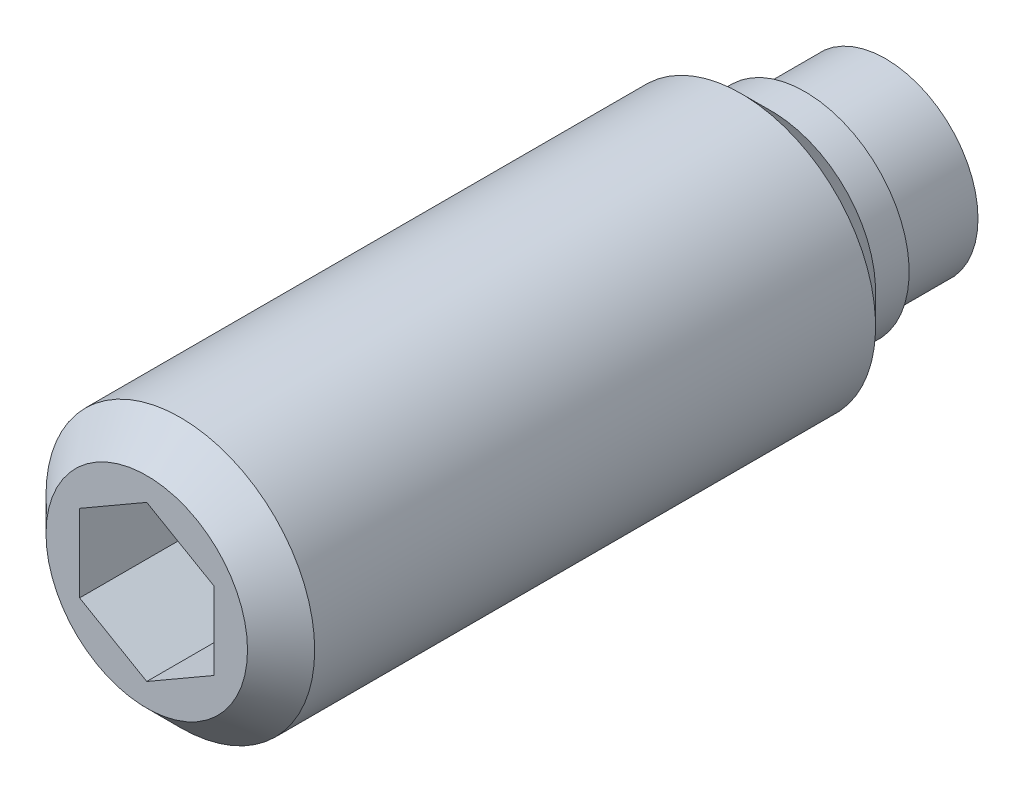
ISO-10303-21;
HEADER;
FILE_DESCRIPTION(('STEP AP214'),'2;1');
FILE_NAME('part.step','',(''),(''),'','','');
FILE_SCHEMA(('AUTOMOTIVE_DESIGN { 1 0 10303 214 1 1 1 1 }'));
ENDSEC;
DATA;
#1=APPLICATION_CONTEXT('core data for automotive mechanical design processes');
#2=APPLICATION_PROTOCOL_DEFINITION('international standard','automotive_design',2000,#1);
#3=PRODUCT_CONTEXT('',#1,'mechanical');
#4=PRODUCT('Part','Part','',(#3));
#5=PRODUCT_RELATED_PRODUCT_CATEGORY('part','',(#4));
#6=PRODUCT_DEFINITION_FORMATION('','',#4);
#7=PRODUCT_DEFINITION_CONTEXT('part definition',#1,'design');
#8=PRODUCT_DEFINITION('design','',#6,#7);
#9=PRODUCT_DEFINITION_SHAPE('','',#8);
#10=(LENGTH_UNIT() NAMED_UNIT(*) SI_UNIT(.MILLI.,.METRE.));
#11=(NAMED_UNIT(*) PLANE_ANGLE_UNIT() SI_UNIT($,.RADIAN.));
#12=(NAMED_UNIT(*) SI_UNIT($,.STERADIAN.) SOLID_ANGLE_UNIT());
#13=UNCERTAINTY_MEASURE_WITH_UNIT(LENGTH_MEASURE(1.E-05),#10,'distance_accuracy_value','');
#14=(GEOMETRIC_REPRESENTATION_CONTEXT(3) GLOBAL_UNCERTAINTY_ASSIGNED_CONTEXT((#13)) GLOBAL_UNIT_ASSIGNED_CONTEXT((#10,
#11,#12)) REPRESENTATION_CONTEXT('',''));
#15=CARTESIAN_POINT('',(0.,0.,0.));
#16=DIRECTION('',(0.,0.,1.));
#17=DIRECTION('',(1.,0.,0.));
#18=AXIS2_PLACEMENT_3D('',#15,#16,#17);
#19=CARTESIAN_POINT('',(0.,3.1,3.2));
#20=DIRECTION('',(0.,0.,1.));
#21=DIRECTION('',(1.,0.,0.));
#22=AXIS2_PLACEMENT_3D('',#19,#20,#21);
#23=PLANE('',#22);
#24=CARTESIAN_POINT('',(0.,0.,3.2));
#25=DIRECTION('',(0.,0.,-1.));
#26=DIRECTION('',(-1.,0.,0.));
#27=AXIS2_PLACEMENT_3D('',#24,#25,#26);
#28=CIRCLE('',#27,2.75);
#29=CARTESIAN_POINT('',(-2.75000000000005,0.,3.2));
#30=VERTEX_POINT('',#29);
#31=EDGE_CURVE('E124',#30,#30,#28,.T.);
#32=ORIENTED_EDGE('',*,*,#31,.F.);
#33=EDGE_LOOP('',(#32));
#34=FACE_BOUND('',#33,.T.);
#35=CARTESIAN_POINT('',(0.,0.,3.2));
#36=DIRECTION('',(0.,0.,-1.));
#37=DIRECTION('',(-1.,0.,0.));
#38=AXIS2_PLACEMENT_3D('',#35,#36,#37);
#39=CIRCLE('',#38,3.1);
#40=CARTESIAN_POINT('',(-3.10000000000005,0.,3.2));
#41=VERTEX_POINT('',#40);
#42=EDGE_CURVE('E127',#41,#41,#39,.T.);
#43=ORIENTED_EDGE('',*,*,#42,.T.);
#44=EDGE_LOOP('',(#43));
#45=FACE_BOUND('',#44,.T.);
#46=ADVANCED_FACE('F14',(#34,#45),#23,.F.);
#47=CARTESIAN_POINT('',(0.,0.,3.2));
#48=DIRECTION('',(0.,0.,-1.));
#49=DIRECTION('',(-1.,0.,0.));
#50=AXIS2_PLACEMENT_3D('',#47,#48,#49);
#51=CYLINDRICAL_SURFACE('',#50,4.);
#52=CARTESIAN_POINT('',(0.,0.,21.8));
#53=DIRECTION('',(0.,0.,1.));
#54=DIRECTION('',(1.,0.,0.));
#55=AXIS2_PLACEMENT_3D('',#52,#53,#54);
#56=CIRCLE('',#55,4.);
#57=CARTESIAN_POINT('',(3.99999999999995,0.,21.8));
#58=VERTEX_POINT('',#57);
#59=EDGE_CURVE('E9',#58,#58,#56,.F.);
#60=ORIENTED_EDGE('',*,*,#59,.T.);
#61=EDGE_LOOP('',(#60));
#62=FACE_BOUND('',#61,.T.);
#63=CARTESIAN_POINT('',(0.,0.,5.1));
#64=DIRECTION('',(0.,0.,-1.));
#65=DIRECTION('',(-1.,0.,0.));
#66=AXIS2_PLACEMENT_3D('',#63,#64,#65);
#67=CIRCLE('',#66,4.);
#68=CARTESIAN_POINT('',(-4.00000000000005,0.,5.1));
#69=VERTEX_POINT('',#68);
#70=EDGE_CURVE('E133',#69,#69,#67,.T.);
#71=ORIENTED_EDGE('',*,*,#70,.F.);
#72=EDGE_LOOP('',(#71));
#73=FACE_BOUND('',#72,.T.);
#74=ADVANCED_FACE('F151',(#62,#73),#51,.T.);
#75=CARTESIAN_POINT('',(0.,0.,5.1));
#76=DIRECTION('',(0.,0.,1.));
#77=DIRECTION('',(1.,0.,0.));
#78=AXIS2_PLACEMENT_3D('',#75,#76,#77);
#79=CONICAL_SURFACE('',#78,4.,0.785398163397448);
#80=CARTESIAN_POINT('',(0.,0.,4.2));
#81=DIRECTION('',(0.,0.,-1.));
#82=DIRECTION('',(-1.,0.,0.));
#83=AXIS2_PLACEMENT_3D('',#80,#81,#82);
#84=CIRCLE('',#83,3.1);
#85=CARTESIAN_POINT('',(-3.10000000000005,0.,4.2));
#86=VERTEX_POINT('',#85);
#87=EDGE_CURVE('E130',#86,#86,#84,.T.);
#88=ORIENTED_EDGE('',*,*,#87,.F.);
#89=EDGE_LOOP('',(#88));
#90=FACE_BOUND('',#89,.T.);
#91=ORIENTED_EDGE('',*,*,#70,.T.);
#92=EDGE_LOOP('',(#91));
#93=FACE_BOUND('',#92,.T.);
#94=ADVANCED_FACE('F158',(#90,#93),#79,.T.);
#95=CARTESIAN_POINT('',(0.,0.,3.2));
#96=DIRECTION('',(0.,0.,-1.));
#97=DIRECTION('',(-1.,0.,0.));
#98=AXIS2_PLACEMENT_3D('',#95,#96,#97);
#99=CYLINDRICAL_SURFACE('',#98,3.1);
#100=ORIENTED_EDGE('',*,*,#42,.F.);
#101=EDGE_LOOP('',(#100));
#102=FACE_BOUND('',#101,.T.);
#103=ORIENTED_EDGE('',*,*,#87,.T.);
#104=EDGE_LOOP('',(#103));
#105=FACE_BOUND('',#104,.T.);
#106=ADVANCED_FACE('F166',(#102,#105),#99,.T.);
#107=CARTESIAN_POINT('',(0.,0.,0.));
#108=DIRECTION('',(0.,0.,-1.));
#109=DIRECTION('',(-1.,0.,0.));
#110=AXIS2_PLACEMENT_3D('',#107,#108,#109);
#111=CYLINDRICAL_SURFACE('',#110,2.75);
#112=CARTESIAN_POINT('',(0.,0.,0.8));
#113=DIRECTION('',(0.,0.,-1.));
#114=DIRECTION('',(-1.,0.,0.));
#115=AXIS2_PLACEMENT_3D('',#112,#113,#114);
#116=CIRCLE('',#115,2.75);
#117=CARTESIAN_POINT('',(-2.75000000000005,0.,0.8));
#118=VERTEX_POINT('',#117);
#119=EDGE_CURVE('E114',#118,#118,#116,.T.);
#120=ORIENTED_EDGE('',*,*,#119,.F.);
#121=EDGE_LOOP('',(#120));
#122=FACE_BOUND('',#121,.T.);
#123=ORIENTED_EDGE('',*,*,#31,.T.);
#124=EDGE_LOOP('',(#123));
#125=FACE_BOUND('',#124,.T.);
#126=ADVANCED_FACE('F164',(#122,#125),#111,.T.);
#127=CARTESIAN_POINT('',(-0.0368577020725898,0.,4.99986414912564));
#128=DIRECTION('',(0.,-1.,0.));
#129=DIRECTION('',(-1.,0.,0.));
#130=AXIS2_PLACEMENT_3D('',#127,#128,#129);
#131=CIRCLE('',#130,4.99999999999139);
#132=TRIMMED_CURVE('',#131,(PARAMETER_VALUE(-1.57816793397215)),
(PARAMETER_VALUE(1.57816793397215)),.T.,.PARAMETER.);
#133=CARTESIAN_POINT('',(0.,0.,4.99986414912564));
#134=DIRECTION('',(0.,0.,-1.));
#135=AXIS1_PLACEMENT('',#133,#134);
#136=SURFACE_OF_REVOLUTION('',#132,#135);
#137=ORIENTED_EDGE('',*,*,#119,.T.);
#138=EDGE_LOOP('',(#137));
#139=FACE_BOUND('',#138,.T.);
#140=CARTESIAN_POINT('',(0.,0.,0.));
#141=VERTEX_POINT('',#140);
#142=VERTEX_LOOP('',#141);
#143=FACE_BOUND('',#142,.T.);
#144=ADVANCED_FACE('F198',(#139,#143),#136,.T.);
#145=CARTESIAN_POINT('',(0.,0.,22.8));
#146=DIRECTION('',(0.,0.,1.));
#147=DIRECTION('',(1.,0.,0.));
#148=AXIS2_PLACEMENT_3D('',#145,#146,#147);
#149=PLANE('',#148);
#150=CARTESIAN_POINT('',(0.,0.,22.8));
#151=DIRECTION('',(0.,0.,1.));
#152=DIRECTION('',(1.,0.,0.));
#153=AXIS2_PLACEMENT_3D('',#150,#151,#152);
#154=CIRCLE('',#153,3.);
#155=CARTESIAN_POINT('',(2.99999999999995,0.,22.8));
#156=VERTEX_POINT('',#155);
#157=EDGE_CURVE('E22',#156,#156,#154,.T.);
#158=ORIENTED_EDGE('',*,*,#157,.T.);
#159=EDGE_LOOP('',(#158));
#160=FACE_BOUND('',#159,.T.);
#161=DIRECTION('',(-0.866025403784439,0.5,0.));
#162=VECTOR('',#161,1.);
#163=CARTESIAN_POINT('',(2.,1.15470053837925,22.8));
#164=LINE('',#163,#162);
#165=CARTESIAN_POINT('',(2.,1.15470053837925,22.8));
#166=VERTEX_POINT('',#165);
#167=CARTESIAN_POINT('',(0.,2.30940107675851,22.8));
#168=VERTEX_POINT('',#167);
#169=EDGE_CURVE('E29',#166,#168,#164,.T.);
#170=ORIENTED_EDGE('',*,*,#169,.F.);
#171=DIRECTION('',(0.,1.,0.));
#172=VECTOR('',#171,1.);
#173=CARTESIAN_POINT('',(2.,-1.15470053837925,22.8));
#174=LINE('',#173,#172);
#175=CARTESIAN_POINT('',(2.,-1.15470053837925,22.8));
#176=VERTEX_POINT('',#175);
#177=EDGE_CURVE('E88',#176,#166,#174,.T.);
#178=ORIENTED_EDGE('',*,*,#177,.F.);
#179=DIRECTION('',(0.866025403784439,0.5,0.));
#180=VECTOR('',#179,1.);
#181=CARTESIAN_POINT('',(0.,-2.30940107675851,22.8));
#182=LINE('',#181,#180);
#183=CARTESIAN_POINT('',(0.,-2.30940107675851,22.8));
#184=VERTEX_POINT('',#183);
#185=EDGE_CURVE('E91',#184,#176,#182,.T.);
#186=ORIENTED_EDGE('',*,*,#185,.F.);
#187=DIRECTION('',(0.866025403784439,-0.5,0.));
#188=VECTOR('',#187,1.);
#189=CARTESIAN_POINT('',(-2.,-1.15470053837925,22.8));
#190=LINE('',#189,#188);
#191=CARTESIAN_POINT('',(-2.,-1.15470053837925,22.8));
#192=VERTEX_POINT('',#191);
#193=EDGE_CURVE('E107',#192,#184,#190,.T.);
#194=ORIENTED_EDGE('',*,*,#193,.F.);
#195=DIRECTION('',(0.,-1.,0.));
#196=VECTOR('',#195,1.);
#197=CARTESIAN_POINT('',(-2.,1.15470053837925,22.8));
#198=LINE('',#197,#196);
#199=CARTESIAN_POINT('',(-2.,1.15470053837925,22.8));
#200=VERTEX_POINT('',#199);
#201=EDGE_CURVE('E104',#200,#192,#198,.T.);
#202=ORIENTED_EDGE('',*,*,#201,.F.);
#203=DIRECTION('',(-0.866025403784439,-0.5,0.));
#204=VECTOR('',#203,1.);
#205=CARTESIAN_POINT('',(0.,2.30940107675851,22.8));
#206=LINE('',#205,#204);
#207=EDGE_CURVE('E102',#168,#200,#206,.T.);
#208=ORIENTED_EDGE('',*,*,#207,.F.);
#209=EDGE_LOOP('',(#170,#178,#186,#194,#202,#208));
#210=FACE_BOUND('',#209,.T.);
#211=ADVANCED_FACE('F138',(#160,#210),#149,.T.);
#212=CARTESIAN_POINT('',(2.,1.15470053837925,18.8));
#213=DIRECTION('',(0.5,0.866025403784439,0.));
#214=DIRECTION('',(-0.866025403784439,0.5,0.));
#215=AXIS2_PLACEMENT_3D('',#212,#213,#214);
#216=PLANE('',#215);
#217=ORIENTED_EDGE('',*,*,#169,.T.);
#218=DIRECTION('',(0.,0.,1.));
#219=VECTOR('',#218,1.);
#220=CARTESIAN_POINT('',(0.,2.30940107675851,18.8));
#221=LINE('',#220,#219);
#222=CARTESIAN_POINT('',(0.,2.30940107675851,18.8));
#223=VERTEX_POINT('',#222);
#224=EDGE_CURVE('E65',#223,#168,#221,.T.);
#225=ORIENTED_EDGE('',*,*,#224,.F.);
#226=DIRECTION('',(-0.866025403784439,0.5,0.));
#227=VECTOR('',#226,1.);
#228=CARTESIAN_POINT('',(2.,1.15470053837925,18.8));
#229=LINE('',#228,#227);
#230=CARTESIAN_POINT('',(2.,1.15470053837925,18.8));
#231=VERTEX_POINT('',#230);
#232=EDGE_CURVE('E69',#231,#223,#229,.T.);
#233=ORIENTED_EDGE('',*,*,#232,.F.);
#234=DIRECTION('',(0.,0.,1.));
#235=VECTOR('',#234,1.);
#236=CARTESIAN_POINT('',(2.,1.15470053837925,18.8));
#237=LINE('',#236,#235);
#238=EDGE_CURVE('E112',#231,#166,#237,.T.);
#239=ORIENTED_EDGE('',*,*,#238,.T.);
#240=EDGE_LOOP('',(#217,#225,#233,#239));
#241=FACE_BOUND('',#240,.T.);
#242=ADVANCED_FACE('F67',(#241),#216,.F.);
#243=CARTESIAN_POINT('',(2.,-1.15470053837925,18.8));
#244=DIRECTION('',(1.,0.,0.));
#245=DIRECTION('',(0.,0.,-1.));
#246=AXIS2_PLACEMENT_3D('',#243,#244,#245);
#247=PLANE('',#246);
#248=ORIENTED_EDGE('',*,*,#177,.T.);
#249=ORIENTED_EDGE('',*,*,#238,.F.);
#250=DIRECTION('',(0.,1.,0.));
#251=VECTOR('',#250,1.);
#252=CARTESIAN_POINT('',(2.,-1.15470053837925,18.8));
#253=LINE('',#252,#251);
#254=CARTESIAN_POINT('',(2.,-1.15470053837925,18.8));
#255=VERTEX_POINT('',#254);
#256=EDGE_CURVE('E75',#255,#231,#253,.T.);
#257=ORIENTED_EDGE('',*,*,#256,.F.);
#258=DIRECTION('',(0.,0.,1.));
#259=VECTOR('',#258,1.);
#260=CARTESIAN_POINT('',(2.,-1.15470053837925,18.8));
#261=LINE('',#260,#259);
#262=EDGE_CURVE('E115',#255,#176,#261,.T.);
#263=ORIENTED_EDGE('',*,*,#262,.T.);
#264=EDGE_LOOP('',(#248,#249,#257,#263));
#265=FACE_BOUND('',#264,.T.);
#266=ADVANCED_FACE('F220',(#265),#247,.F.);
#267=CARTESIAN_POINT('',(0.,-2.30940107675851,18.8));
#268=DIRECTION('',(0.5,-0.866025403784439,0.));
#269=DIRECTION('',(0.866025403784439,0.5,0.));
#270=AXIS2_PLACEMENT_3D('',#267,#268,#269);
#271=PLANE('',#270);
#272=ORIENTED_EDGE('',*,*,#185,.T.);
#273=ORIENTED_EDGE('',*,*,#262,.F.);
#274=DIRECTION('',(0.866025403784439,0.5,0.));
#275=VECTOR('',#274,1.);
#276=CARTESIAN_POINT('',(0.,-2.30940107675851,18.8));
#277=LINE('',#276,#275);
#278=CARTESIAN_POINT('',(0.,-2.30940107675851,18.8));
#279=VERTEX_POINT('',#278);
#280=EDGE_CURVE('E98',#279,#255,#277,.T.);
#281=ORIENTED_EDGE('',*,*,#280,.F.);
#282=DIRECTION('',(0.,0.,1.));
#283=VECTOR('',#282,1.);
#284=CARTESIAN_POINT('',(0.,-2.30940107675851,18.8));
#285=LINE('',#284,#283);
#286=EDGE_CURVE('E117',#279,#184,#285,.T.);
#287=ORIENTED_EDGE('',*,*,#286,.T.);
#288=EDGE_LOOP('',(#272,#273,#281,#287));
#289=FACE_BOUND('',#288,.T.);
#290=ADVANCED_FACE('F228',(#289),#271,.F.);
#291=CARTESIAN_POINT('',(-2.,-1.15470053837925,18.8));
#292=DIRECTION('',(-0.5,-0.866025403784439,0.));
#293=DIRECTION('',(0.866025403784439,-0.5,0.));
#294=AXIS2_PLACEMENT_3D('',#291,#292,#293);
#295=PLANE('',#294);
#296=ORIENTED_EDGE('',*,*,#193,.T.);
#297=ORIENTED_EDGE('',*,*,#286,.F.);
#298=DIRECTION('',(0.866025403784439,-0.5,0.));
#299=VECTOR('',#298,1.);
#300=CARTESIAN_POINT('',(-2.,-1.15470053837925,18.8));
#301=LINE('',#300,#299);
#302=CARTESIAN_POINT('',(-2.,-1.15470053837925,18.8));
#303=VERTEX_POINT('',#302);
#304=EDGE_CURVE('E95',#303,#279,#301,.T.);
#305=ORIENTED_EDGE('',*,*,#304,.F.);
#306=DIRECTION('',(0.,0.,1.));
#307=VECTOR('',#306,1.);
#308=CARTESIAN_POINT('',(-2.,-1.15470053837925,18.8));
#309=LINE('',#308,#307);
#310=EDGE_CURVE('E119',#303,#192,#309,.T.);
#311=ORIENTED_EDGE('',*,*,#310,.T.);
#312=EDGE_LOOP('',(#296,#297,#305,#311));
#313=FACE_BOUND('',#312,.T.);
#314=ADVANCED_FACE('F237',(#313),#295,.F.);
#315=CARTESIAN_POINT('',(-2.,1.15470053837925,18.8));
#316=DIRECTION('',(-1.,0.,0.));
#317=DIRECTION('',(0.,0.,1.));
#318=AXIS2_PLACEMENT_3D('',#315,#316,#317);
#319=PLANE('',#318);
#320=ORIENTED_EDGE('',*,*,#201,.T.);
#321=ORIENTED_EDGE('',*,*,#310,.F.);
#322=DIRECTION('',(0.,-1.,0.));
#323=VECTOR('',#322,1.);
#324=CARTESIAN_POINT('',(-2.,1.15470053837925,18.8));
#325=LINE('',#324,#323);
#326=CARTESIAN_POINT('',(-2.,1.15470053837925,18.8));
#327=VERTEX_POINT('',#326);
#328=EDGE_CURVE('E83',#327,#303,#325,.T.);
#329=ORIENTED_EDGE('',*,*,#328,.F.);
#330=DIRECTION('',(0.,0.,1.));
#331=VECTOR('',#330,1.);
#332=CARTESIAN_POINT('',(-2.,1.15470053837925,18.8));
#333=LINE('',#332,#331);
#334=EDGE_CURVE('E74',#327,#200,#333,.T.);
#335=ORIENTED_EDGE('',*,*,#334,.T.);
#336=EDGE_LOOP('',(#320,#321,#329,#335));
#337=FACE_BOUND('',#336,.T.);
#338=ADVANCED_FACE('F246',(#337),#319,.F.);
#339=CARTESIAN_POINT('',(0.,2.30940107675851,18.8));
#340=DIRECTION('',(-0.5,0.866025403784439,0.));
#341=DIRECTION('',(-0.866025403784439,-0.5,0.));
#342=AXIS2_PLACEMENT_3D('',#339,#340,#341);
#343=PLANE('',#342);
#344=ORIENTED_EDGE('',*,*,#207,.T.);
#345=ORIENTED_EDGE('',*,*,#334,.F.);
#346=DIRECTION('',(-0.866025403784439,-0.5,0.));
#347=VECTOR('',#346,1.);
#348=CARTESIAN_POINT('',(0.,2.30940107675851,18.8));
#349=LINE('',#348,#347);
#350=EDGE_CURVE('E78',#223,#327,#349,.T.);
#351=ORIENTED_EDGE('',*,*,#350,.F.);
#352=ORIENTED_EDGE('',*,*,#224,.T.);
#353=EDGE_LOOP('',(#344,#345,#351,#352));
#354=FACE_BOUND('',#353,.T.);
#355=ADVANCED_FACE('F79',(#354),#343,.F.);
#356=CARTESIAN_POINT('',(0.,0.,18.8));
#357=DIRECTION('',(0.,0.,1.));
#358=DIRECTION('',(1.,0.,0.));
#359=AXIS2_PLACEMENT_3D('',#356,#357,#358);
#360=PLANE('',#359);
#361=ORIENTED_EDGE('',*,*,#232,.T.);
#362=ORIENTED_EDGE('',*,*,#350,.T.);
#363=ORIENTED_EDGE('',*,*,#328,.T.);
#364=ORIENTED_EDGE('',*,*,#304,.T.);
#365=ORIENTED_EDGE('',*,*,#280,.T.);
#366=ORIENTED_EDGE('',*,*,#256,.T.);
#367=EDGE_LOOP('',(#361,#362,#363,#364,#365,#366));
#368=FACE_BOUND('',#367,.T.);
#369=ADVANCED_FACE('F85',(#368),#360,.T.);
#370=CARTESIAN_POINT('',(0.,0.,22.8));
#371=DIRECTION('',(0.,0.,-1.));
#372=DIRECTION('',(-1.,0.,0.));
#373=AXIS2_PLACEMENT_3D('',#370,#371,#372);
#374=CONICAL_SURFACE('',#373,3.,0.785398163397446);
#375=ORIENTED_EDGE('',*,*,#59,.F.);
#376=EDGE_LOOP('',(#375));
#377=FACE_BOUND('',#376,.T.);
#378=ORIENTED_EDGE('',*,*,#157,.F.);
#379=EDGE_LOOP('',(#378));
#380=FACE_BOUND('',#379,.T.);
#381=ADVANCED_FACE('F16',(#377,#380),#374,.T.);
#382=CLOSED_SHELL('',(#46,#74,#94,#106,#126,#144,#211,#242,#266,#290,#314,#338,#355,#369,#381));
#383=MANIFOLD_SOLID_BREP('B1',#382);
#384=ADVANCED_BREP_SHAPE_REPRESENTATION('',(#18,#383),#14);
#385=SHAPE_DEFINITION_REPRESENTATION(#9,#384);
ENDSEC;
END-ISO-10303-21;
